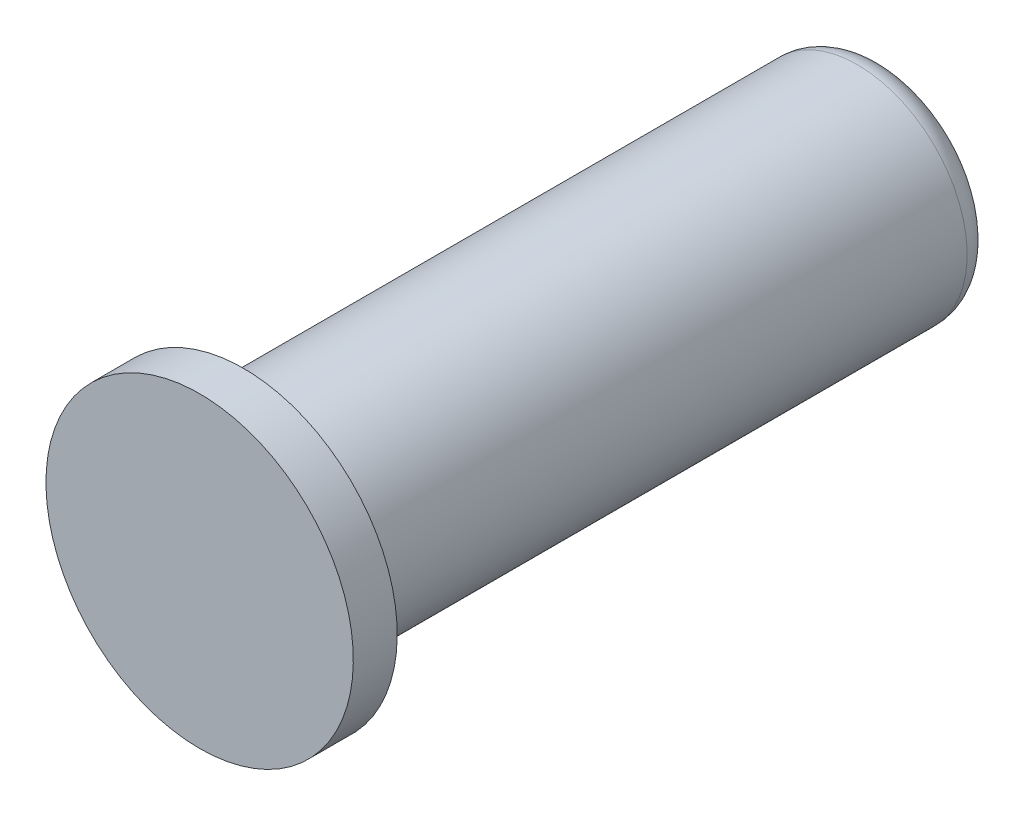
from build123d import *


with BuildPart() as part:
    # Sketch1 → Revolve1 (revolve)
    with BuildSketch(Plane(origin=(0, 0, 0), x_dir=(0, 0, -1), z_dir=(1, 0, 0)), mode=Mode.PRIVATE) as revolve1_sk:
        with BuildLine():
            Line((0, 0), (0, 17.5))
            Line((0, 17.5), (5, 17.5))
            Line((5, 17.5), (5, 12.5))
            Line((5, 12.5), (74.9, 12.5))
            ThreePointArc((74.9, 12.5), (77.021320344, 11.621320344), (77.9, 9.5))
            Line((77.9, 9.5), (77.9, 4.5))
            Line((77.9, 4.5), (77.4, 4))
            Line((77.4, 4), (68.9, 4))
            Line((68.9, 4), (66.590598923, 0))
            Line((66.590598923, 0), (0, 0))
        make_face()
    revolve(revolve1_sk.sketch.rotate(Axis((0, 0, 0), (0, 0, -1)), 180), axis=Axis((0, 0, 0), (0, 0, -1)))


solid = part.part
